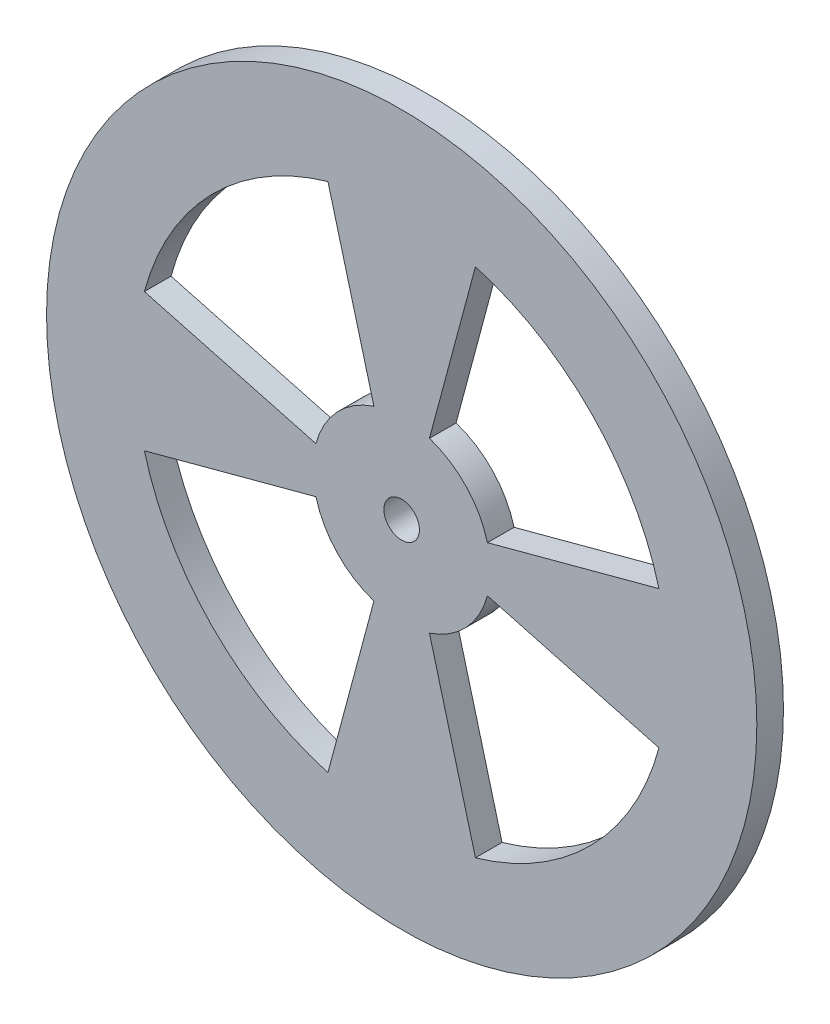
ISO-10303-21;
HEADER;
FILE_DESCRIPTION(('STEP AP214'),'2;1');
FILE_NAME('part.step','',(''),(''),'','','');
FILE_SCHEMA(('AUTOMOTIVE_DESIGN { 1 0 10303 214 1 1 1 1 }'));
ENDSEC;
DATA;
#1=APPLICATION_CONTEXT('core data for automotive mechanical design processes');
#2=APPLICATION_PROTOCOL_DEFINITION('international standard','automotive_design',2000,#1);
#3=PRODUCT_CONTEXT('',#1,'mechanical');
#4=PRODUCT('Part','Part','',(#3));
#5=PRODUCT_RELATED_PRODUCT_CATEGORY('part','',(#4));
#6=PRODUCT_DEFINITION_FORMATION('','',#4);
#7=PRODUCT_DEFINITION_CONTEXT('part definition',#1,'design');
#8=PRODUCT_DEFINITION('design','',#6,#7);
#9=PRODUCT_DEFINITION_SHAPE('','',#8);
#10=(LENGTH_UNIT() NAMED_UNIT(*) SI_UNIT(.MILLI.,.METRE.));
#11=(NAMED_UNIT(*) PLANE_ANGLE_UNIT() SI_UNIT($,.RADIAN.));
#12=(NAMED_UNIT(*) SI_UNIT($,.STERADIAN.) SOLID_ANGLE_UNIT());
#13=UNCERTAINTY_MEASURE_WITH_UNIT(LENGTH_MEASURE(1.E-05),#10,'distance_accuracy_value','');
#14=(GEOMETRIC_REPRESENTATION_CONTEXT(3) GLOBAL_UNCERTAINTY_ASSIGNED_CONTEXT((#13)) GLOBAL_UNIT_ASSIGNED_CONTEXT((#10,
#11,#12)) REPRESENTATION_CONTEXT('',''));
#15=CARTESIAN_POINT('',(0.,0.,0.));
#16=DIRECTION('',(0.,0.,1.));
#17=DIRECTION('',(1.,0.,0.));
#18=AXIS2_PLACEMENT_3D('',#15,#16,#17);
#19=CARTESIAN_POINT('',(-0.543627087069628,-0.145664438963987,3.));
#20=DIRECTION('',(0.96592582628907,0.258819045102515,0.));
#21=DIRECTION('',(-0.258819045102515,0.96592582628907,0.));
#22=AXIS2_PLACEMENT_3D('',#19,#20,#21);
#23=PLANE('',#22);
#24=DIRECTION('',(0.258819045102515,-0.96592582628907,0.));
#25=VECTOR('',#24,1.);
#26=CARTESIAN_POINT('',(-0.543627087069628,-0.145664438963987,0.));
#27=LINE('',#26,#25);
#28=CARTESIAN_POINT('',(-8.30683197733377,28.8270106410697,0.));
#29=VERTEX_POINT('',#28);
#30=CARTESIAN_POINT('',(-3.12771525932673,9.49828391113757,0.));
#31=VERTEX_POINT('',#30);
#32=EDGE_CURVE('E220',#29,#31,#27,.T.);
#33=ORIENTED_EDGE('',*,*,#32,.T.);
#34=DIRECTION('',(0.,0.,-1.));
#35=VECTOR('',#34,1.);
#36=CARTESIAN_POINT('',(-3.12771525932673,9.49828391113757,3.));
#37=LINE('',#36,#35);
#38=CARTESIAN_POINT('',(-3.12771525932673,9.49828391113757,3.));
#39=VERTEX_POINT('',#38);
#40=EDGE_CURVE('E11',#39,#31,#37,.T.);
#41=ORIENTED_EDGE('',*,*,#40,.F.);
#42=DIRECTION('',(0.258819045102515,-0.96592582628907,0.));
#43=VECTOR('',#42,1.);
#44=CARTESIAN_POINT('',(-0.543627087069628,-0.145664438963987,3.));
#45=LINE('',#44,#43);
#46=CARTESIAN_POINT('',(-8.30683197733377,28.8270106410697,3.));
#47=VERTEX_POINT('',#46);
#48=EDGE_CURVE('E163',#47,#39,#45,.T.);
#49=ORIENTED_EDGE('',*,*,#48,.F.);
#50=DIRECTION('',(0.,0.,-1.));
#51=VECTOR('',#50,1.);
#52=CARTESIAN_POINT('',(-8.30683197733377,28.8270106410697,3.));
#53=LINE('',#52,#51);
#54=EDGE_CURVE('E54',#47,#29,#53,.T.);
#55=ORIENTED_EDGE('',*,*,#54,.T.);
#56=EDGE_LOOP('',(#33,#41,#49,#55));
#57=FACE_BOUND('',#56,.T.);
#58=ADVANCED_FACE('F35',(#57),#23,.F.);
#59=CARTESIAN_POINT('',(0.,0.,3.));
#60=DIRECTION('',(0.,0.,-1.));
#61=DIRECTION('',(-1.,0.,0.));
#62=AXIS2_PLACEMENT_3D('',#59,#60,#61);
#63=CYLINDRICAL_SURFACE('',#62,10.);
#64=CARTESIAN_POINT('',(0.,0.,0.));
#65=DIRECTION('',(0.,0.,1.));
#66=DIRECTION('',(1.,0.,0.));
#67=AXIS2_PLACEMENT_3D('',#64,#65,#66);
#68=CIRCLE('',#67,10.);
#69=CARTESIAN_POINT('',(-9.65925826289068,2.58819045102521,0.));
#70=VERTEX_POINT('',#69);
#71=EDGE_CURVE('E171',#31,#70,#68,.T.);
#72=ORIENTED_EDGE('',*,*,#71,.T.);
#73=DIRECTION('',(0.,0.,-1.));
#74=VECTOR('',#73,1.);
#75=CARTESIAN_POINT('',(-9.65925826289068,2.58819045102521,3.));
#76=LINE('',#75,#74);
#77=CARTESIAN_POINT('',(-9.65925826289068,2.58819045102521,3.));
#78=VERTEX_POINT('',#77);
#79=EDGE_CURVE('E45',#78,#70,#76,.T.);
#80=ORIENTED_EDGE('',*,*,#79,.F.);
#81=CARTESIAN_POINT('',(0.,0.,3.));
#82=DIRECTION('',(0.,0.,1.));
#83=DIRECTION('',(1.,0.,0.));
#84=AXIS2_PLACEMENT_3D('',#81,#82,#83);
#85=CIRCLE('',#84,10.);
#86=EDGE_CURVE('E156',#39,#78,#85,.T.);
#87=ORIENTED_EDGE('',*,*,#86,.F.);
#88=ORIENTED_EDGE('',*,*,#40,.T.);
#89=EDGE_LOOP('',(#72,#80,#87,#88));
#90=FACE_BOUND('',#89,.T.);
#91=ADVANCED_FACE('F170',(#90),#63,.T.);
#92=CARTESIAN_POINT('',(0.,0.,3.));
#93=DIRECTION('',(-0.258819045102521,-0.965925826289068,0.));
#94=DIRECTION('',(0.965925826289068,-0.258819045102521,0.));
#95=AXIS2_PLACEMENT_3D('',#92,#93,#94);
#96=PLANE('',#95);
#97=DIRECTION('',(-0.965925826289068,0.258819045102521,0.));
#98=VECTOR('',#97,1.);
#99=CARTESIAN_POINT('',(0.,0.,0.));
#100=LINE('',#99,#98);
#101=CARTESIAN_POINT('',(-28.9777747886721,7.76457135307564,0.));
#102=VERTEX_POINT('',#101);
#103=EDGE_CURVE('E222',#70,#102,#100,.T.);
#104=ORIENTED_EDGE('',*,*,#103,.T.);
#105=DIRECTION('',(0.,0.,-1.));
#106=VECTOR('',#105,1.);
#107=CARTESIAN_POINT('',(-28.9777747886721,7.76457135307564,3.));
#108=LINE('',#107,#106);
#109=CARTESIAN_POINT('',(-28.9777747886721,7.76457135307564,3.));
#110=VERTEX_POINT('',#109);
#111=EDGE_CURVE('E105',#110,#102,#108,.T.);
#112=ORIENTED_EDGE('',*,*,#111,.F.);
#113=DIRECTION('',(-0.965925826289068,0.258819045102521,0.));
#114=VECTOR('',#113,1.);
#115=CARTESIAN_POINT('',(0.,0.,3.));
#116=LINE('',#115,#114);
#117=EDGE_CURVE('E162',#78,#110,#116,.T.);
#118=ORIENTED_EDGE('',*,*,#117,.F.);
#119=ORIENTED_EDGE('',*,*,#79,.T.);
#120=EDGE_LOOP('',(#104,#112,#118,#119));
#121=FACE_BOUND('',#120,.T.);
#122=ADVANCED_FACE('F175',(#121),#96,.F.);
#123=CARTESIAN_POINT('',(0.,0.,3.));
#124=DIRECTION('',(-0.258819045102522,0.965925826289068,0.));
#125=DIRECTION('',(-0.965925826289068,-0.258819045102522,0.));
#126=AXIS2_PLACEMENT_3D('',#123,#124,#125);
#127=PLANE('',#126);
#128=DIRECTION('',(0.965925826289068,0.258819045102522,0.));
#129=VECTOR('',#128,1.);
#130=CARTESIAN_POINT('',(0.,0.,0.));
#131=LINE('',#130,#129);
#132=CARTESIAN_POINT('',(9.65925826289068,2.58819045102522,0.));
#133=VERTEX_POINT('',#132);
#134=CARTESIAN_POINT('',(28.9777747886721,7.76457135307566,0.));
#135=VERTEX_POINT('',#134);
#136=EDGE_CURVE('E212',#133,#135,#131,.T.);
#137=ORIENTED_EDGE('',*,*,#136,.F.);
#138=DIRECTION('',(0.,0.,-1.));
#139=VECTOR('',#138,1.);
#140=CARTESIAN_POINT('',(9.65925826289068,2.58819045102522,3.));
#141=LINE('',#140,#139);
#142=CARTESIAN_POINT('',(9.65925826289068,2.58819045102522,3.));
#143=VERTEX_POINT('',#142);
#144=EDGE_CURVE('E232',#143,#133,#141,.T.);
#145=ORIENTED_EDGE('',*,*,#144,.F.);
#146=DIRECTION('',(0.965925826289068,0.258819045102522,0.));
#147=VECTOR('',#146,1.);
#148=CARTESIAN_POINT('',(0.,0.,3.));
#149=LINE('',#148,#147);
#150=CARTESIAN_POINT('',(28.9777747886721,7.76457135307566,3.));
#151=VERTEX_POINT('',#150);
#152=EDGE_CURVE('E444',#143,#151,#149,.T.);
#153=ORIENTED_EDGE('',*,*,#152,.T.);
#154=DIRECTION('',(0.,0.,-1.));
#155=VECTOR('',#154,1.);
#156=CARTESIAN_POINT('',(28.9777747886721,7.76457135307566,3.));
#157=LINE('',#156,#155);
#158=EDGE_CURVE('E234',#151,#135,#157,.T.);
#159=ORIENTED_EDGE('',*,*,#158,.T.);
#160=EDGE_LOOP('',(#137,#145,#153,#159));
#161=FACE_BOUND('',#160,.T.);
#162=ADVANCED_FACE('F297',(#161),#127,.T.);
#163=CARTESIAN_POINT('',(3.12771525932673,9.49828391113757,0.));
#164=VERTEX_POINT('',#163);
#165=EDGE_CURVE('E215',#133,#164,#68,.T.);
#166=ORIENTED_EDGE('',*,*,#165,.T.);
#167=DIRECTION('',(0.,0.,-1.));
#168=VECTOR('',#167,1.);
#169=CARTESIAN_POINT('',(3.12771525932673,9.49828391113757,3.));
#170=LINE('',#169,#168);
#171=CARTESIAN_POINT('',(3.12771525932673,9.49828391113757,3.));
#172=VERTEX_POINT('',#171);
#173=EDGE_CURVE('E239',#172,#164,#170,.T.);
#174=ORIENTED_EDGE('',*,*,#173,.F.);
#175=EDGE_CURVE('E167',#143,#172,#85,.T.);
#176=ORIENTED_EDGE('',*,*,#175,.F.);
#177=ORIENTED_EDGE('',*,*,#144,.T.);
#178=EDGE_LOOP('',(#166,#174,#176,#177));
#179=FACE_BOUND('',#178,.T.);
#180=ADVANCED_FACE('F289',(#179),#63,.T.);
#181=CARTESIAN_POINT('',(0.543627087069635,-0.145664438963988,3.));
#182=DIRECTION('',(0.96592582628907,-0.258819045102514,0.));
#183=DIRECTION('',(0.258819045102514,0.96592582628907,0.));
#184=AXIS2_PLACEMENT_3D('',#181,#182,#183);
#185=PLANE('',#184);
#186=DIRECTION('',(-0.258819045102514,-0.96592582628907,0.));
#187=VECTOR('',#186,1.);
#188=CARTESIAN_POINT('',(0.543627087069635,-0.145664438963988,0.));
#189=LINE('',#188,#187);
#190=CARTESIAN_POINT('',(8.30683197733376,28.8270106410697,0.));
#191=VERTEX_POINT('',#190);
#192=EDGE_CURVE('E216',#191,#164,#189,.T.);
#193=ORIENTED_EDGE('',*,*,#192,.F.);
#194=DIRECTION('',(0.,0.,-1.));
#195=VECTOR('',#194,1.);
#196=CARTESIAN_POINT('',(8.30683197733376,28.8270106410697,3.));
#197=LINE('',#196,#195);
#198=CARTESIAN_POINT('',(8.30683197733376,28.8270106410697,3.));
#199=VERTEX_POINT('',#198);
#200=EDGE_CURVE('E236',#199,#191,#197,.T.);
#201=ORIENTED_EDGE('',*,*,#200,.F.);
#202=DIRECTION('',(-0.258819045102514,-0.96592582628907,0.));
#203=VECTOR('',#202,1.);
#204=CARTESIAN_POINT('',(0.543627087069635,-0.145664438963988,3.));
#205=LINE('',#204,#203);
#206=EDGE_CURVE('E439',#199,#172,#205,.T.);
#207=ORIENTED_EDGE('',*,*,#206,.T.);
#208=ORIENTED_EDGE('',*,*,#173,.T.);
#209=EDGE_LOOP('',(#193,#201,#207,#208));
#210=FACE_BOUND('',#209,.T.);
#211=ADVANCED_FACE('F292',(#210),#185,.T.);
#212=CARTESIAN_POINT('',(0.543627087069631,0.145664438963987,3.));
#213=DIRECTION('',(-0.96592582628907,-0.258819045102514,0.));
#214=DIRECTION('',(0.258819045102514,-0.96592582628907,0.));
#215=AXIS2_PLACEMENT_3D('',#212,#213,#214);
#216=PLANE('',#215);
#217=DIRECTION('',(-0.258819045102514,0.96592582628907,0.));
#218=VECTOR('',#217,1.);
#219=CARTESIAN_POINT('',(0.543627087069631,0.145664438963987,0.));
#220=LINE('',#219,#218);
#221=CARTESIAN_POINT('',(8.30683197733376,-28.8270106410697,0.));
#222=VERTEX_POINT('',#221);
#223=CARTESIAN_POINT('',(3.12771525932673,-9.49828391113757,0.));
#224=VERTEX_POINT('',#223);
#225=EDGE_CURVE('E204',#222,#224,#220,.T.);
#226=ORIENTED_EDGE('',*,*,#225,.T.);
#227=DIRECTION('',(0.,0.,-1.));
#228=VECTOR('',#227,1.);
#229=CARTESIAN_POINT('',(3.12771525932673,-9.49828391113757,3.));
#230=LINE('',#229,#228);
#231=CARTESIAN_POINT('',(3.12771525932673,-9.49828391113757,3.));
#232=VERTEX_POINT('',#231);
#233=EDGE_CURVE('E237',#232,#224,#230,.T.);
#234=ORIENTED_EDGE('',*,*,#233,.F.);
#235=DIRECTION('',(-0.258819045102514,0.96592582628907,0.));
#236=VECTOR('',#235,1.);
#237=CARTESIAN_POINT('',(0.543627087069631,0.145664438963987,3.));
#238=LINE('',#237,#236);
#239=CARTESIAN_POINT('',(8.30683197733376,-28.8270106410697,3.));
#240=VERTEX_POINT('',#239);
#241=EDGE_CURVE('E451',#240,#232,#238,.T.);
#242=ORIENTED_EDGE('',*,*,#241,.F.);
#243=DIRECTION('',(0.,0.,-1.));
#244=VECTOR('',#243,1.);
#245=CARTESIAN_POINT('',(8.30683197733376,-28.8270106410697,3.));
#246=LINE('',#245,#244);
#247=EDGE_CURVE('E242',#240,#222,#246,.T.);
#248=ORIENTED_EDGE('',*,*,#247,.T.);
#249=EDGE_LOOP('',(#226,#234,#242,#248));
#250=FACE_BOUND('',#249,.T.);
#251=ADVANCED_FACE('F295',(#250),#216,.F.);
#252=CARTESIAN_POINT('',(9.65925826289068,-2.58819045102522,0.));
#253=VERTEX_POINT('',#252);
#254=EDGE_CURVE('E198',#224,#253,#68,.T.);
#255=ORIENTED_EDGE('',*,*,#254,.T.);
#256=DIRECTION('',(0.,0.,-1.));
#257=VECTOR('',#256,1.);
#258=CARTESIAN_POINT('',(9.65925826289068,-2.58819045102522,3.));
#259=LINE('',#258,#257);
#260=CARTESIAN_POINT('',(9.65925826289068,-2.58819045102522,3.));
#261=VERTEX_POINT('',#260);
#262=EDGE_CURVE('E246',#261,#253,#259,.T.);
#263=ORIENTED_EDGE('',*,*,#262,.F.);
#264=EDGE_CURVE('E445',#232,#261,#85,.T.);
#265=ORIENTED_EDGE('',*,*,#264,.F.);
#266=ORIENTED_EDGE('',*,*,#233,.T.);
#267=EDGE_LOOP('',(#255,#263,#265,#266));
#268=FACE_BOUND('',#267,.T.);
#269=ADVANCED_FACE('F282',(#268),#63,.T.);
#270=CARTESIAN_POINT('',(0.,0.,3.));
#271=DIRECTION('',(0.258819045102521,0.965925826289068,0.));
#272=DIRECTION('',(-0.965925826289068,0.258819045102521,0.));
#273=AXIS2_PLACEMENT_3D('',#270,#271,#272);
#274=PLANE('',#273);
#275=DIRECTION('',(0.965925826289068,-0.258819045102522,0.));
#276=VECTOR('',#275,1.);
#277=CARTESIAN_POINT('',(0.,0.,0.));
#278=LINE('',#277,#276);
#279=CARTESIAN_POINT('',(28.9777747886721,-7.76457135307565,0.));
#280=VERTEX_POINT('',#279);
#281=EDGE_CURVE('E209',#253,#280,#278,.T.);
#282=ORIENTED_EDGE('',*,*,#281,.T.);
#283=DIRECTION('',(0.,0.,-1.));
#284=VECTOR('',#283,1.);
#285=CARTESIAN_POINT('',(28.9777747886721,-7.76457135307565,3.));
#286=LINE('',#285,#284);
#287=CARTESIAN_POINT('',(28.9777747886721,-7.76457135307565,3.));
#288=VERTEX_POINT('',#287);
#289=EDGE_CURVE('E244',#288,#280,#286,.T.);
#290=ORIENTED_EDGE('',*,*,#289,.F.);
#291=DIRECTION('',(0.965925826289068,-0.258819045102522,0.));
#292=VECTOR('',#291,1.);
#293=CARTESIAN_POINT('',(0.,0.,3.));
#294=LINE('',#293,#292);
#295=EDGE_CURVE('E449',#261,#288,#294,.T.);
#296=ORIENTED_EDGE('',*,*,#295,.F.);
#297=ORIENTED_EDGE('',*,*,#262,.T.);
#298=EDGE_LOOP('',(#282,#290,#296,#297));
#299=FACE_BOUND('',#298,.T.);
#300=ADVANCED_FACE('F301',(#299),#274,.F.);
#301=CARTESIAN_POINT('',(0.,0.,3.));
#302=DIRECTION('',(0.258819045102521,-0.965925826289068,0.));
#303=DIRECTION('',(0.965925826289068,0.258819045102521,0.));
#304=AXIS2_PLACEMENT_3D('',#301,#302,#303);
#305=PLANE('',#304);
#306=DIRECTION('',(-0.965925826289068,-0.258819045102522,0.));
#307=VECTOR('',#306,1.);
#308=CARTESIAN_POINT('',(0.,0.,0.));
#309=LINE('',#308,#307);
#310=CARTESIAN_POINT('',(-9.65925826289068,-2.58819045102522,0.));
#311=VERTEX_POINT('',#310);
#312=CARTESIAN_POINT('',(-28.9777747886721,-7.76457135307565,0.));
#313=VERTEX_POINT('',#312);
#314=EDGE_CURVE('E191',#311,#313,#309,.T.);
#315=ORIENTED_EDGE('',*,*,#314,.F.);
#316=DIRECTION('',(0.,0.,-1.));
#317=VECTOR('',#316,1.);
#318=CARTESIAN_POINT('',(-9.65925826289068,-2.58819045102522,3.));
#319=LINE('',#318,#317);
#320=CARTESIAN_POINT('',(-9.65925826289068,-2.58819045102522,3.));
#321=VERTEX_POINT('',#320);
#322=EDGE_CURVE('E39',#321,#311,#319,.T.);
#323=ORIENTED_EDGE('',*,*,#322,.F.);
#324=DIRECTION('',(-0.965925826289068,-0.258819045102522,0.));
#325=VECTOR('',#324,1.);
#326=CARTESIAN_POINT('',(0.,0.,3.));
#327=LINE('',#326,#325);
#328=CARTESIAN_POINT('',(-28.9777747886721,-7.76457135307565,3.));
#329=VERTEX_POINT('',#328);
#330=EDGE_CURVE('E230',#321,#329,#327,.T.);
#331=ORIENTED_EDGE('',*,*,#330,.T.);
#332=DIRECTION('',(0.,0.,-1.));
#333=VECTOR('',#332,1.);
#334=CARTESIAN_POINT('',(-28.9777747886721,-7.76457135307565,3.));
#335=LINE('',#334,#333);
#336=EDGE_CURVE('E190',#329,#313,#335,.T.);
#337=ORIENTED_EDGE('',*,*,#336,.T.);
#338=EDGE_LOOP('',(#315,#323,#331,#337));
#339=FACE_BOUND('',#338,.T.);
#340=ADVANCED_FACE('F37',(#339),#305,.T.);
#341=CARTESIAN_POINT('',(-3.12771525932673,-9.49828391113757,0.));
#342=VERTEX_POINT('',#341);
#343=EDGE_CURVE('E194',#311,#342,#68,.T.);
#344=ORIENTED_EDGE('',*,*,#343,.T.);
#345=DIRECTION('',(0.,0.,-1.));
#346=VECTOR('',#345,1.);
#347=CARTESIAN_POINT('',(-3.12771525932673,-9.49828391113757,3.));
#348=LINE('',#347,#346);
#349=CARTESIAN_POINT('',(-3.12771525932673,-9.49828391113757,3.));
#350=VERTEX_POINT('',#349);
#351=EDGE_CURVE('E253',#350,#342,#348,.T.);
#352=ORIENTED_EDGE('',*,*,#351,.F.);
#353=EDGE_CURVE('E168',#321,#350,#85,.T.);
#354=ORIENTED_EDGE('',*,*,#353,.F.);
#355=ORIENTED_EDGE('',*,*,#322,.T.);
#356=EDGE_LOOP('',(#344,#352,#354,#355));
#357=FACE_BOUND('',#356,.T.);
#358=ADVANCED_FACE('F260',(#357),#63,.T.);
#359=CARTESIAN_POINT('',(-0.543627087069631,0.145664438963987,3.));
#360=DIRECTION('',(-0.96592582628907,0.258819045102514,0.));
#361=DIRECTION('',(-0.258819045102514,-0.96592582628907,0.));
#362=AXIS2_PLACEMENT_3D('',#359,#360,#361);
#363=PLANE('',#362);
#364=DIRECTION('',(0.258819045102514,0.96592582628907,0.));
#365=VECTOR('',#364,1.);
#366=CARTESIAN_POINT('',(-0.543627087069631,0.145664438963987,0.));
#367=LINE('',#366,#365);
#368=CARTESIAN_POINT('',(-8.30683197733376,-28.8270106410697,0.));
#369=VERTEX_POINT('',#368);
#370=EDGE_CURVE('E197',#369,#342,#367,.T.);
#371=ORIENTED_EDGE('',*,*,#370,.F.);
#372=DIRECTION('',(0.,0.,-1.));
#373=VECTOR('',#372,1.);
#374=CARTESIAN_POINT('',(-8.30683197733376,-28.8270106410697,3.));
#375=LINE('',#374,#373);
#376=CARTESIAN_POINT('',(-8.30683197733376,-28.8270106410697,3.));
#377=VERTEX_POINT('',#376);
#378=EDGE_CURVE('E252',#377,#369,#375,.T.);
#379=ORIENTED_EDGE('',*,*,#378,.F.);
#380=DIRECTION('',(0.258819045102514,0.96592582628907,0.));
#381=VECTOR('',#380,1.);
#382=CARTESIAN_POINT('',(-0.543627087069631,0.145664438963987,3.));
#383=LINE('',#382,#381);
#384=EDGE_CURVE('E454',#377,#350,#383,.T.);
#385=ORIENTED_EDGE('',*,*,#384,.T.);
#386=ORIENTED_EDGE('',*,*,#351,.T.);
#387=EDGE_LOOP('',(#371,#379,#385,#386));
#388=FACE_BOUND('',#387,.T.);
#389=ADVANCED_FACE('F271',(#388),#363,.T.);
#390=CARTESIAN_POINT('',(0.,0.,3.));
#391=DIRECTION('',(0.,0.,-1.));
#392=DIRECTION('',(-1.,0.,0.));
#393=AXIS2_PLACEMENT_3D('',#390,#391,#392);
#394=CYLINDRICAL_SURFACE('',#393,40.);
#395=CARTESIAN_POINT('',(0.,0.,3.));
#396=DIRECTION('',(0.,0.,1.));
#397=DIRECTION('',(1.,0.,0.));
#398=AXIS2_PLACEMENT_3D('',#395,#396,#397);
#399=CIRCLE('',#398,40.);
#400=CARTESIAN_POINT('',(40.,0.,3.));
#401=VERTEX_POINT('',#400);
#402=EDGE_CURVE('E178',#401,#401,#399,.T.);
#403=ORIENTED_EDGE('',*,*,#402,.F.);
#404=EDGE_LOOP('',(#403));
#405=FACE_BOUND('',#404,.T.);
#406=CARTESIAN_POINT('',(0.,0.,0.));
#407=DIRECTION('',(0.,0.,1.));
#408=DIRECTION('',(1.,0.,0.));
#409=AXIS2_PLACEMENT_3D('',#406,#407,#408);
#410=CIRCLE('',#409,40.);
#411=CARTESIAN_POINT('',(40.,0.,0.));
#412=VERTEX_POINT('',#411);
#413=EDGE_CURVE('E224',#412,#412,#410,.T.);
#414=ORIENTED_EDGE('',*,*,#413,.T.);
#415=EDGE_LOOP('',(#414));
#416=FACE_BOUND('',#415,.T.);
#417=ADVANCED_FACE('F273',(#405,#416),#394,.T.);
#418=CARTESIAN_POINT('',(0.,0.,3.));
#419=DIRECTION('',(0.,0.,-1.));
#420=DIRECTION('',(-1.,0.,0.));
#421=AXIS2_PLACEMENT_3D('',#418,#419,#420);
#422=CYLINDRICAL_SURFACE('',#421,30.);
#423=CARTESIAN_POINT('',(0.,0.,0.));
#424=DIRECTION('',(0.,0.,1.));
#425=DIRECTION('',(1.,0.,0.));
#426=AXIS2_PLACEMENT_3D('',#423,#424,#425);
#427=CIRCLE('',#426,30.);
#428=EDGE_CURVE('E205',#29,#102,#427,.T.);
#429=ORIENTED_EDGE('',*,*,#428,.F.);
#430=ORIENTED_EDGE('',*,*,#54,.F.);
#431=CARTESIAN_POINT('',(0.,0.,3.));
#432=DIRECTION('',(0.,0.,1.));
#433=DIRECTION('',(1.,0.,0.));
#434=AXIS2_PLACEMENT_3D('',#431,#432,#433);
#435=CIRCLE('',#434,30.);
#436=EDGE_CURVE('E176',#47,#110,#435,.T.);
#437=ORIENTED_EDGE('',*,*,#436,.T.);
#438=ORIENTED_EDGE('',*,*,#111,.T.);
#439=EDGE_LOOP('',(#429,#430,#437,#438));
#440=FACE_BOUND('',#439,.T.);
#441=ADVANCED_FACE('F278',(#440),#422,.F.);
#442=EDGE_CURVE('E219',#135,#191,#427,.T.);
#443=ORIENTED_EDGE('',*,*,#442,.F.);
#444=ORIENTED_EDGE('',*,*,#158,.F.);
#445=EDGE_CURVE('E180',#151,#199,#435,.T.);
#446=ORIENTED_EDGE('',*,*,#445,.T.);
#447=ORIENTED_EDGE('',*,*,#200,.T.);
#448=EDGE_LOOP('',(#443,#444,#446,#447));
#449=FACE_BOUND('',#448,.T.);
#450=ADVANCED_FACE('F327',(#449),#422,.F.);
#451=EDGE_CURVE('E206',#222,#280,#427,.T.);
#452=ORIENTED_EDGE('',*,*,#451,.F.);
#453=ORIENTED_EDGE('',*,*,#247,.F.);
#454=EDGE_CURVE('E443',#240,#288,#435,.T.);
#455=ORIENTED_EDGE('',*,*,#454,.T.);
#456=ORIENTED_EDGE('',*,*,#289,.T.);
#457=EDGE_LOOP('',(#452,#453,#455,#456));
#458=FACE_BOUND('',#457,.T.);
#459=ADVANCED_FACE('F318',(#458),#422,.F.);
#460=EDGE_CURVE('E201',#313,#369,#427,.T.);
#461=ORIENTED_EDGE('',*,*,#460,.F.);
#462=ORIENTED_EDGE('',*,*,#336,.F.);
#463=EDGE_CURVE('E181',#329,#377,#435,.T.);
#464=ORIENTED_EDGE('',*,*,#463,.T.);
#465=ORIENTED_EDGE('',*,*,#378,.T.);
#466=EDGE_LOOP('',(#461,#462,#464,#465));
#467=FACE_BOUND('',#466,.T.);
#468=ADVANCED_FACE('F269',(#467),#422,.F.);
#469=CARTESIAN_POINT('',(0.,0.,3.));
#470=DIRECTION('',(0.,0.,-1.));
#471=DIRECTION('',(-1.,0.,0.));
#472=AXIS2_PLACEMENT_3D('',#469,#470,#471);
#473=CYLINDRICAL_SURFACE('',#472,2.);
#474=CARTESIAN_POINT('',(0.,0.,3.));
#475=DIRECTION('',(0.,0.,1.));
#476=DIRECTION('',(1.,0.,0.));
#477=AXIS2_PLACEMENT_3D('',#474,#475,#476);
#478=CIRCLE('',#477,2.);
#479=CARTESIAN_POINT('',(2.,0.,3.));
#480=VERTEX_POINT('',#479);
#481=EDGE_CURVE('E187',#480,#480,#478,.T.);
#482=ORIENTED_EDGE('',*,*,#481,.T.);
#483=EDGE_LOOP('',(#482));
#484=FACE_BOUND('',#483,.T.);
#485=CARTESIAN_POINT('',(0.,0.,0.));
#486=DIRECTION('',(0.,0.,1.));
#487=DIRECTION('',(1.,0.,0.));
#488=AXIS2_PLACEMENT_3D('',#485,#486,#487);
#489=CIRCLE('',#488,2.);
#490=CARTESIAN_POINT('',(2.,0.,0.));
#491=VERTEX_POINT('',#490);
#492=EDGE_CURVE('E227',#491,#491,#489,.T.);
#493=ORIENTED_EDGE('',*,*,#492,.F.);
#494=EDGE_LOOP('',(#493));
#495=FACE_BOUND('',#494,.T.);
#496=ADVANCED_FACE('F334',(#484,#495),#473,.F.);
#497=CARTESIAN_POINT('',(0.,0.,3.));
#498=DIRECTION('',(0.,0.,1.));
#499=DIRECTION('',(1.,0.,0.));
#500=AXIS2_PLACEMENT_3D('',#497,#498,#499);
#501=PLANE('',#500);
#502=ORIENTED_EDGE('',*,*,#330,.F.);
#503=ORIENTED_EDGE('',*,*,#353,.T.);
#504=ORIENTED_EDGE('',*,*,#384,.F.);
#505=ORIENTED_EDGE('',*,*,#463,.F.);
#506=EDGE_LOOP('',(#502,#503,#504,#505));
#507=FACE_BOUND('',#506,.T.);
#508=ORIENTED_EDGE('',*,*,#241,.T.);
#509=ORIENTED_EDGE('',*,*,#264,.T.);
#510=ORIENTED_EDGE('',*,*,#295,.T.);
#511=ORIENTED_EDGE('',*,*,#454,.F.);
#512=EDGE_LOOP('',(#508,#509,#510,#511));
#513=FACE_BOUND('',#512,.T.);
#514=ORIENTED_EDGE('',*,*,#152,.F.);
#515=ORIENTED_EDGE('',*,*,#175,.T.);
#516=ORIENTED_EDGE('',*,*,#206,.F.);
#517=ORIENTED_EDGE('',*,*,#445,.F.);
#518=EDGE_LOOP('',(#514,#515,#516,#517));
#519=FACE_BOUND('',#518,.T.);
#520=ORIENTED_EDGE('',*,*,#48,.T.);
#521=ORIENTED_EDGE('',*,*,#86,.T.);
#522=ORIENTED_EDGE('',*,*,#117,.T.);
#523=ORIENTED_EDGE('',*,*,#436,.F.);
#524=EDGE_LOOP('',(#520,#521,#522,#523));
#525=FACE_BOUND('',#524,.T.);
#526=ORIENTED_EDGE('',*,*,#402,.T.);
#527=EDGE_LOOP('',(#526));
#528=FACE_BOUND('',#527,.T.);
#529=ORIENTED_EDGE('',*,*,#481,.F.);
#530=EDGE_LOOP('',(#529));
#531=FACE_BOUND('',#530,.T.);
#532=ADVANCED_FACE('F158',(#507,#513,#519,#525,#528,#531),#501,.T.);
#533=CARTESIAN_POINT('',(0.,0.,0.));
#534=DIRECTION('',(0.,0.,1.));
#535=DIRECTION('',(1.,0.,0.));
#536=AXIS2_PLACEMENT_3D('',#533,#534,#535);
#537=PLANE('',#536);
#538=ORIENTED_EDGE('',*,*,#314,.T.);
#539=ORIENTED_EDGE('',*,*,#460,.T.);
#540=ORIENTED_EDGE('',*,*,#370,.T.);
#541=ORIENTED_EDGE('',*,*,#343,.F.);
#542=EDGE_LOOP('',(#538,#539,#540,#541));
#543=FACE_BOUND('',#542,.T.);
#544=ORIENTED_EDGE('',*,*,#225,.F.);
#545=ORIENTED_EDGE('',*,*,#451,.T.);
#546=ORIENTED_EDGE('',*,*,#281,.F.);
#547=ORIENTED_EDGE('',*,*,#254,.F.);
#548=EDGE_LOOP('',(#544,#545,#546,#547));
#549=FACE_BOUND('',#548,.T.);
#550=ORIENTED_EDGE('',*,*,#136,.T.);
#551=ORIENTED_EDGE('',*,*,#442,.T.);
#552=ORIENTED_EDGE('',*,*,#192,.T.);
#553=ORIENTED_EDGE('',*,*,#165,.F.);
#554=EDGE_LOOP('',(#550,#551,#552,#553));
#555=FACE_BOUND('',#554,.T.);
#556=ORIENTED_EDGE('',*,*,#32,.F.);
#557=ORIENTED_EDGE('',*,*,#428,.T.);
#558=ORIENTED_EDGE('',*,*,#103,.F.);
#559=ORIENTED_EDGE('',*,*,#71,.F.);
#560=EDGE_LOOP('',(#556,#557,#558,#559));
#561=FACE_BOUND('',#560,.T.);
#562=ORIENTED_EDGE('',*,*,#413,.F.);
#563=EDGE_LOOP('',(#562));
#564=FACE_BOUND('',#563,.T.);
#565=ORIENTED_EDGE('',*,*,#492,.T.);
#566=EDGE_LOOP('',(#565));
#567=FACE_BOUND('',#566,.T.);
#568=ADVANCED_FACE('F263',(#543,#549,#555,#561,#564,#567),#537,.F.);
#569=CLOSED_SHELL('',(#58,#91,#122,#162,#180,#211,#251,#269,#300,#340,#358,#389,#417,#441,#450,
#459,#468,#496,#532,#568));
#570=MANIFOLD_SOLID_BREP('B2',#569);
#571=ADVANCED_BREP_SHAPE_REPRESENTATION('',(#18,#570),#14);
#572=SHAPE_DEFINITION_REPRESENTATION(#9,#571);
ENDSEC;
END-ISO-10303-21;
